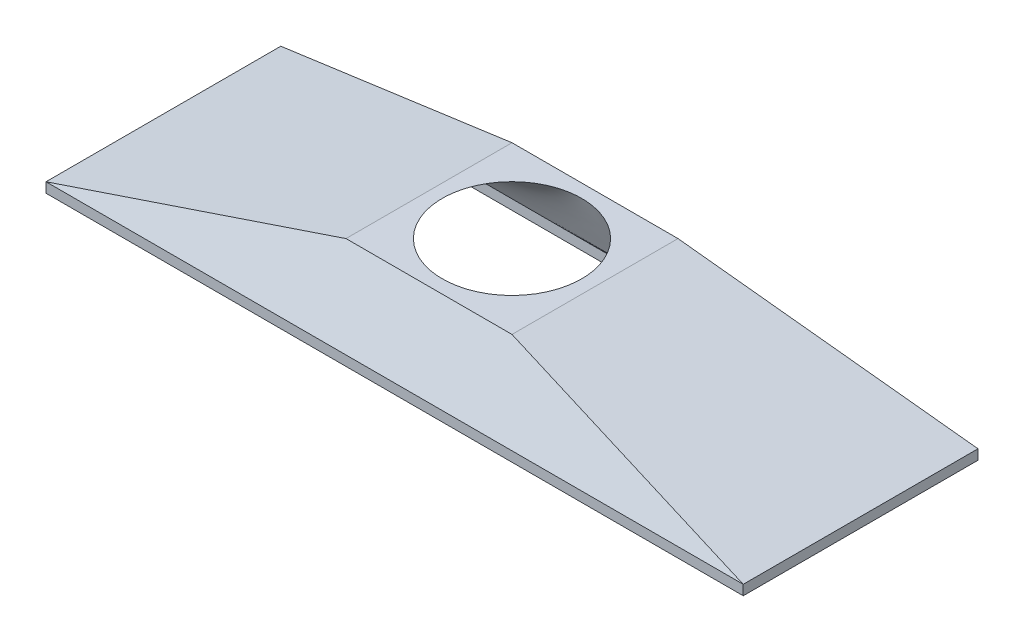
ISO-10303-21;
HEADER;
FILE_DESCRIPTION(('STEP AP214'),'2;1');
FILE_NAME('part.step','',(''),(''),'','','');
FILE_SCHEMA(('AUTOMOTIVE_DESIGN { 1 0 10303 214 1 1 1 1 }'));
ENDSEC;
DATA;
#1=APPLICATION_CONTEXT('core data for automotive mechanical design processes');
#2=APPLICATION_PROTOCOL_DEFINITION('international standard','automotive_design',2000,#1);
#3=PRODUCT_CONTEXT('',#1,'mechanical');
#4=PRODUCT('Part','Part','',(#3));
#5=PRODUCT_RELATED_PRODUCT_CATEGORY('part','',(#4));
#6=PRODUCT_DEFINITION_FORMATION('','',#4);
#7=PRODUCT_DEFINITION_CONTEXT('part definition',#1,'design');
#8=PRODUCT_DEFINITION('design','',#6,#7);
#9=PRODUCT_DEFINITION_SHAPE('','',#8);
#10=(LENGTH_UNIT() NAMED_UNIT(*) SI_UNIT(.MILLI.,.METRE.));
#11=(NAMED_UNIT(*) PLANE_ANGLE_UNIT() SI_UNIT($,.RADIAN.));
#12=(NAMED_UNIT(*) SI_UNIT($,.STERADIAN.) SOLID_ANGLE_UNIT());
#13=UNCERTAINTY_MEASURE_WITH_UNIT(LENGTH_MEASURE(1.E-05),#10,'distance_accuracy_value','');
#14=(GEOMETRIC_REPRESENTATION_CONTEXT(3) GLOBAL_UNCERTAINTY_ASSIGNED_CONTEXT((#13)) GLOBAL_UNIT_ASSIGNED_CONTEXT((#10,
#11,#12)) REPRESENTATION_CONTEXT('',''));
#15=CARTESIAN_POINT('',(0.,0.,0.));
#16=DIRECTION('',(0.,0.,1.));
#17=DIRECTION('',(1.,0.,0.));
#18=AXIS2_PLACEMENT_3D('',#15,#16,#17);
#19=CARTESIAN_POINT('',(0.,20.,0.));
#20=DIRECTION('',(0.,-1.,0.));
#21=DIRECTION('',(0.,0.,-1.));
#22=AXIS2_PLACEMENT_3D('',#19,#20,#21);
#23=PLANE('',#22);
#24=CARTESIAN_POINT('',(0.,20.,0.));
#25=DIRECTION('',(0.,1.,0.));
#26=DIRECTION('',(0.,0.,1.));
#27=AXIS2_PLACEMENT_3D('',#24,#25,#26);
#28=CIRCLE('',#27,21.);
#29=CARTESIAN_POINT('',(-20.0946117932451,20.,-6.09971940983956));
#30=VERTEX_POINT('',#29);
#31=CARTESIAN_POINT('',(-20.0946117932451,20.,6.09971940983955));
#32=VERTEX_POINT('',#31);
#33=EDGE_CURVE('E214',#30,#32,#28,.T.);
#34=ORIENTED_EDGE('',*,*,#33,.F.);
#35=CARTESIAN_POINT('',(20.0946117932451,20.,-6.09971940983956));
#36=VERTEX_POINT('',#35);
#37=EDGE_CURVE('E213',#36,#30,#28,.T.);
#38=ORIENTED_EDGE('',*,*,#37,.F.);
#39=CARTESIAN_POINT('',(20.0946117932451,20.,6.09971940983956));
#40=VERTEX_POINT('',#39);
#41=EDGE_CURVE('E211',#40,#36,#28,.T.);
#42=ORIENTED_EDGE('',*,*,#41,.F.);
#43=EDGE_CURVE('E206',#32,#40,#28,.T.);
#44=ORIENTED_EDGE('',*,*,#43,.F.);
#45=EDGE_LOOP('',(#34,#38,#42,#44));
#46=FACE_BOUND('',#45,.T.);
#47=DIRECTION('',(0.,0.,-1.));
#48=VECTOR('',#47,1.);
#49=CARTESIAN_POINT('',(25.,20.,25.));
#50=LINE('',#49,#48);
#51=CARTESIAN_POINT('',(25.,20.,25.));
#52=VERTEX_POINT('',#51);
#53=CARTESIAN_POINT('',(25.,20.,-25.));
#54=VERTEX_POINT('',#53);
#55=EDGE_CURVE('E303',#52,#54,#50,.T.);
#56=ORIENTED_EDGE('',*,*,#55,.T.);
#57=DIRECTION('',(-1.,0.,0.));
#58=VECTOR('',#57,1.);
#59=CARTESIAN_POINT('',(-25.,20.,-25.));
#60=LINE('',#59,#58);
#61=CARTESIAN_POINT('',(-25.,20.,-25.));
#62=VERTEX_POINT('',#61);
#63=EDGE_CURVE('E564',#54,#62,#60,.T.);
#64=ORIENTED_EDGE('',*,*,#63,.T.);
#65=DIRECTION('',(0.,0.,1.));
#66=VECTOR('',#65,1.);
#67=CARTESIAN_POINT('',(-25.,20.,25.));
#68=LINE('',#67,#66);
#69=CARTESIAN_POINT('',(-25.,20.,25.));
#70=VERTEX_POINT('',#69);
#71=EDGE_CURVE('E560',#62,#70,#68,.T.);
#72=ORIENTED_EDGE('',*,*,#71,.T.);
#73=DIRECTION('',(1.,0.,0.));
#74=VECTOR('',#73,1.);
#75=CARTESIAN_POINT('',(-25.,20.,25.));
#76=LINE('',#75,#74);
#77=EDGE_CURVE('E557',#70,#52,#76,.T.);
#78=ORIENTED_EDGE('',*,*,#77,.T.);
#79=EDGE_LOOP('',(#56,#64,#72,#78));
#80=FACE_BOUND('',#79,.T.);
#81=ADVANCED_FACE('F71',(#46,#80),#23,.F.);
#82=CARTESIAN_POINT('',(0.,14.4354195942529,-27.8810615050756));
#83=DIRECTION('',(0.,0.459779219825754,-0.888033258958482));
#84=DIRECTION('',(0.,0.888033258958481,0.459779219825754));
#85=AXIS2_PLACEMENT_3D('',#82,#83,#84);
#86=PLANE('',#85);
#87=DIRECTION('',(0.962582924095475,-0.240645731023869,-0.124594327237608));
#88=VECTOR('',#87,1.);
#89=CARTESIAN_POINT('',(25.,20.,-25.));
#90=LINE('',#89,#88);
#91=CARTESIAN_POINT('',(105.,0.,-35.355));
#92=VERTEX_POINT('',#91);
#93=EDGE_CURVE('E559',#54,#92,#90,.T.);
#94=ORIENTED_EDGE('',*,*,#93,.T.);
#95=DIRECTION('',(-1.,0.,0.));
#96=VECTOR('',#95,1.);
#97=CARTESIAN_POINT('',(-105.,0.,-35.355));
#98=LINE('',#97,#96);
#99=CARTESIAN_POINT('',(-105.,0.,-35.355));
#100=VERTEX_POINT('',#99);
#101=EDGE_CURVE('E76',#92,#100,#98,.T.);
#102=ORIENTED_EDGE('',*,*,#101,.T.);
#103=DIRECTION('',(-0.962582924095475,-0.240645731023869,-0.124594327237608));
#104=VECTOR('',#103,1.);
#105=CARTESIAN_POINT('',(-25.,20.,-25.));
#106=LINE('',#105,#104);
#107=EDGE_CURVE('E526',#62,#100,#106,.T.);
#108=ORIENTED_EDGE('',*,*,#107,.F.);
#109=ORIENTED_EDGE('',*,*,#63,.F.);
#110=EDGE_LOOP('',(#94,#102,#108,#109));
#111=FACE_BOUND('',#110,.T.);
#112=ADVANCED_FACE('F343',(#111),#86,.T.);
#113=CARTESIAN_POINT('',(-6.17647058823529,24.7058823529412,0.));
#114=DIRECTION('',(-0.242535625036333,0.970142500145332,0.));
#115=DIRECTION('',(-0.970142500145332,-0.242535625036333,0.));
#116=AXIS2_PLACEMENT_3D('',#113,#114,#115);
#117=PLANE('',#116);
#118=ORIENTED_EDGE('',*,*,#107,.T.);
#119=DIRECTION('',(0.,0.,1.));
#120=VECTOR('',#119,1.);
#121=CARTESIAN_POINT('',(-105.,0.,35.355));
#122=LINE('',#121,#120);
#123=CARTESIAN_POINT('',(-105.,0.,35.355));
#124=VERTEX_POINT('',#123);
#125=EDGE_CURVE('E82',#100,#124,#122,.T.);
#126=ORIENTED_EDGE('',*,*,#125,.T.);
#127=DIRECTION('',(-0.962582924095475,-0.240645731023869,0.124594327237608));
#128=VECTOR('',#127,1.);
#129=CARTESIAN_POINT('',(-25.,20.,25.));
#130=LINE('',#129,#128);
#131=EDGE_CURVE('E516',#70,#124,#130,.T.);
#132=ORIENTED_EDGE('',*,*,#131,.F.);
#133=ORIENTED_EDGE('',*,*,#71,.F.);
#134=EDGE_LOOP('',(#118,#126,#132,#133));
#135=FACE_BOUND('',#134,.T.);
#136=ADVANCED_FACE('F349',(#135),#117,.T.);
#137=CARTESIAN_POINT('',(6.17647058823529,24.7058823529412,0.));
#138=DIRECTION('',(0.242535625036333,0.970142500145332,0.));
#139=DIRECTION('',(-0.970142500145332,0.242535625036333,0.));
#140=AXIS2_PLACEMENT_3D('',#137,#138,#139);
#141=PLANE('',#140);
#142=DIRECTION('',(0.962582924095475,-0.240645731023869,0.124594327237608));
#143=VECTOR('',#142,1.);
#144=CARTESIAN_POINT('',(25.,20.,25.));
#145=LINE('',#144,#143);
#146=CARTESIAN_POINT('',(105.,0.,35.355));
#147=VERTEX_POINT('',#146);
#148=EDGE_CURVE('E520',#52,#147,#145,.T.);
#149=ORIENTED_EDGE('',*,*,#148,.T.);
#150=DIRECTION('',(0.,0.,-1.));
#151=VECTOR('',#150,1.);
#152=CARTESIAN_POINT('',(105.,0.,35.355));
#153=LINE('',#152,#151);
#154=EDGE_CURVE('E511',#147,#92,#153,.T.);
#155=ORIENTED_EDGE('',*,*,#154,.T.);
#156=ORIENTED_EDGE('',*,*,#93,.F.);
#157=ORIENTED_EDGE('',*,*,#55,.F.);
#158=EDGE_LOOP('',(#149,#155,#156,#157));
#159=FACE_BOUND('',#158,.T.);
#160=ADVANCED_FACE('F521',(#159),#141,.T.);
#161=CARTESIAN_POINT('',(0.,14.4354195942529,27.8810615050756));
#162=DIRECTION('',(0.,0.459779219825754,0.888033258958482));
#163=DIRECTION('',(0.,-0.888033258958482,0.459779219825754));
#164=AXIS2_PLACEMENT_3D('',#161,#162,#163);
#165=PLANE('',#164);
#166=ORIENTED_EDGE('',*,*,#131,.T.);
#167=DIRECTION('',(1.,0.,0.));
#168=VECTOR('',#167,1.);
#169=CARTESIAN_POINT('',(-105.,0.,35.355));
#170=LINE('',#169,#168);
#171=EDGE_CURVE('E12',#124,#147,#170,.T.);
#172=ORIENTED_EDGE('',*,*,#171,.T.);
#173=ORIENTED_EDGE('',*,*,#148,.F.);
#174=ORIENTED_EDGE('',*,*,#77,.F.);
#175=EDGE_LOOP('',(#166,#172,#173,#174));
#176=FACE_BOUND('',#175,.T.);
#177=ADVANCED_FACE('F73',(#176),#165,.T.);
#178=CARTESIAN_POINT('',(-20.0946117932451,20.,-6.09971940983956));
#179=CARTESIAN_POINT('',(-100.,0.,-30.355));
#180=CARTESIAN_POINT('',(-19.8514143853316,20.,-6.90089683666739));
#181=CARTESIAN_POINT('',(-95.8333333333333,0.,-30.355));
#182=CARTESIAN_POINT('',(-19.5494886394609,20.,-7.72343461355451));
#183=CARTESIAN_POINT('',(-91.6666666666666,0.,-30.355));
#184=CARTESIAN_POINT('',(-18.8052345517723,20.,-9.39133120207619));
#185=CARTESIAN_POINT('',(-83.3333333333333,0.,-30.355));
#186=CARTESIAN_POINT('',(-18.3627793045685,20.,-10.2367293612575));
#187=CARTESIAN_POINT('',(-79.1666666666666,0.,-30.355));
#188=CARTESIAN_POINT('',(-17.3170494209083,20.,-11.9206581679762));
#189=CARTESIAN_POINT('',(-70.8333333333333,0.,-30.355));
#190=CARTESIAN_POINT('',(-16.713606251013,20.,-12.7591706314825));
#191=CARTESIAN_POINT('',(-66.6666666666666,0.,-30.355));
#192=CARTESIAN_POINT('',(-15.3326447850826,20.,-14.3892693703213));
#193=CARTESIAN_POINT('',(-58.3333333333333,0.,-30.355));
#194=CARTESIAN_POINT('',(-14.5549457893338,20.,-15.1807452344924));
#195=CARTESIAN_POINT('',(-54.1666666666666,0.,-30.355));
#196=CARTESIAN_POINT('',(-12.8247608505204,20.,-16.6681427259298));
#197=CARTESIAN_POINT('',(-45.8333333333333,0.,-30.355));
#198=CARTESIAN_POINT('',(-11.8721404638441,20.,-17.3638449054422));
#199=CARTESIAN_POINT('',(-41.6666666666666,0.,-30.355));
#200=CARTESIAN_POINT('',(-9.80892561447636,20.,-18.6074126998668));
#201=CARTESIAN_POINT('',(-33.3333333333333,0.,-30.355));
#202=CARTESIAN_POINT('',(-8.69831655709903,20.,-19.1549764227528));
#203=CARTESIAN_POINT('',(-29.1666666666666,0.,-30.355));
#204=CARTESIAN_POINT('',(-6.35598204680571,20.,-20.0543093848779));
#205=CARTESIAN_POINT('',(-20.8333333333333,0.,-30.355));
#206=CARTESIAN_POINT('',(-5.12441306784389,20.,-20.4057757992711));
#207=CARTESIAN_POINT('',(-16.6666666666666,0.,-30.355));
#208=CARTESIAN_POINT('',(-2.59508363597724,20.,-20.8787173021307));
#209=CARTESIAN_POINT('',(-8.3333333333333,0.,-30.355));
#210=CARTESIAN_POINT('',(-1.29763596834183,20.,-21.));
#211=CARTESIAN_POINT('',(-4.16666666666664,0.,-30.355));
#212=CARTESIAN_POINT('',(1.29763596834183,20.,-21.));
#213=CARTESIAN_POINT('',(4.16666666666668,0.,-30.355));
#214=CARTESIAN_POINT('',(2.59508363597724,20.,-20.8787173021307));
#215=CARTESIAN_POINT('',(8.33333333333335,0.,-30.355));
#216=CARTESIAN_POINT('',(5.12441306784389,20.,-20.4057757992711));
#217=CARTESIAN_POINT('',(16.6666666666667,0.,-30.355));
#218=CARTESIAN_POINT('',(6.35598204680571,20.,-20.0543093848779));
#219=CARTESIAN_POINT('',(20.8333333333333,0.,-30.355));
#220=CARTESIAN_POINT('',(8.69831655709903,20.,-19.1549764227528));
#221=CARTESIAN_POINT('',(29.1666666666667,0.,-30.355));
#222=CARTESIAN_POINT('',(9.80892561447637,20.,-18.6074126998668));
#223=CARTESIAN_POINT('',(33.3333333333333,0.,-30.355));
#224=CARTESIAN_POINT('',(11.8721404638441,20.,-17.3638449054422));
#225=CARTESIAN_POINT('',(41.6666666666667,0.,-30.355));
#226=CARTESIAN_POINT('',(12.8247608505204,20.,-16.6681427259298));
#227=CARTESIAN_POINT('',(45.8333333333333,0.,-30.355));
#228=CARTESIAN_POINT('',(14.5549457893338,20.,-15.1807452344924));
#229=CARTESIAN_POINT('',(54.1666666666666,0.,-30.355));
#230=CARTESIAN_POINT('',(15.3326447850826,20.,-14.3892693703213));
#231=CARTESIAN_POINT('',(58.3333333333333,0.,-30.355));
#232=CARTESIAN_POINT('',(16.713606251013,20.,-12.7591706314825));
#233=CARTESIAN_POINT('',(66.6666666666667,0.,-30.355));
#234=CARTESIAN_POINT('',(17.3170494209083,20.,-11.9206581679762));
#235=CARTESIAN_POINT('',(70.8333333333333,0.,-30.355));
#236=CARTESIAN_POINT('',(18.3627793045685,20.,-10.2367293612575));
#237=CARTESIAN_POINT('',(79.1666666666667,0.,-30.355));
#238=CARTESIAN_POINT('',(18.8052345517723,20.,-9.39133120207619));
#239=CARTESIAN_POINT('',(83.3333333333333,0.,-30.355));
#240=CARTESIAN_POINT('',(19.5494886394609,20.,-7.72343461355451));
#241=CARTESIAN_POINT('',(91.6666666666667,0.,-30.355));
#242=CARTESIAN_POINT('',(19.8514143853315,20.,-6.90089683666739));
#243=CARTESIAN_POINT('',(95.8333333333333,0.,-30.355));
#244=CARTESIAN_POINT('',(20.0946117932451,20.,-6.09971940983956));
#245=CARTESIAN_POINT('',(100.,0.,-30.355));
#246=B_SPLINE_SURFACE_WITH_KNOTS('',3,1,((#178,#179),(#180,#181),(#182,#183),(#184,#185),(#186,
#187),(#188,#189),(#190,#191),(#192,#193),(#194,#195),(#196,#197),(#198,#199),(#200,#201),(#202,
#203),(#204,#205),(#206,#207),(#208,#209),(#210,#211),(#212,#213),(#214,#215),(#216,#217),(#218,
#219),(#220,#221),(#222,#223),(#224,#225),(#226,#227),(#228,#229),(#230,#231),(#232,#233),(#234,
#235),(#236,#237),(#238,#239),(#240,#241),(#242,#243),(#244,#245)),.UNSPECIFIED.,.F.,.F.,.F.,(4,
2,2,2,2,2,2,2,2,2,2,2,2,2,2,2,4),(2,2),(0.,0.0625000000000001,0.125,0.1875,0.25,0.3125,0.375,
0.4375,0.5,0.5625,0.625,0.6875,0.75,0.8125,0.875,0.9375,1.),(0.,1.),.UNSPECIFIED.);
#247=DIRECTION('',(0.930568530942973,0.232917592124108,0.282474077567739));
#248=VECTOR('',#247,1.);
#249=CARTESIAN_POINT('',(-60.0473058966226,10.,-18.2273597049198));
#250=LINE('',#249,#248);
#251=CARTESIAN_POINT('',(-100.,0.,-30.355));
#252=VERTEX_POINT('',#251);
#253=EDGE_CURVE('E422',#252,#30,#250,.T.);
#254=DIRECTION('',(1.,0.,0.));
#255=VECTOR('',#254,1.);
#256=CARTESIAN_POINT('',(100.,0.,-30.355));
#257=LINE('',#256,#255);
#258=CARTESIAN_POINT('',(100.,0.,-30.355));
#259=VERTEX_POINT('',#258);
#260=EDGE_CURVE('E318',#252,#259,#257,.T.);
#261=DIRECTION('',(0.930568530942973,-0.232917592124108,-0.282474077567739));
#262=VECTOR('',#261,1.);
#263=CARTESIAN_POINT('',(60.0473058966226,10.,-18.2273597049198));
#264=LINE('',#263,#262);
#265=EDGE_CURVE('E425',#36,#259,#264,.T.);
#266=ORIENTED_EDGE('',*,*,#37,.T.);
#267=ORIENTED_EDGE('',*,*,#253,.F.);
#268=ORIENTED_EDGE('',*,*,#260,.T.);
#269=ORIENTED_EDGE('',*,*,#265,.F.);
#270=EDGE_LOOP('',(#266,#267,#268,#269));
#271=FACE_BOUND('',#270,.T.);
#272=ADVANCED_FACE('F421',(#271),#246,.F.);
#273=CARTESIAN_POINT('',(20.0946117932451,20.,-6.09971940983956));
#274=CARTESIAN_POINT('',(100.,0.,-30.355));
#275=CARTESIAN_POINT('',(20.3899020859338,20.,-5.12692977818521));
#276=CARTESIAN_POINT('',(100.,0.,-25.2958333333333));
#277=CARTESIAN_POINT('',(20.6173956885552,20.,-4.12198476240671));
#278=CARTESIAN_POINT('',(100.,0.,-20.2366666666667));
#279=CARTESIAN_POINT('',(20.9224709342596,20.,-2.07797337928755));
#280=CARTESIAN_POINT('',(100.,0.,-10.1183333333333));
#281=CARTESIAN_POINT('',(21.,20.,-1.03901786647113));
#282=CARTESIAN_POINT('',(100.,0.,-5.05916666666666));
#283=CARTESIAN_POINT('',(21.,20.,1.03901786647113));
#284=CARTESIAN_POINT('',(100.,0.,5.05916666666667));
#285=CARTESIAN_POINT('',(20.9224709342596,20.,2.07797337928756));
#286=CARTESIAN_POINT('',(100.,0.,10.1183333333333));
#287=CARTESIAN_POINT('',(20.6173956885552,20.,4.12198476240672));
#288=CARTESIAN_POINT('',(100.,0.,20.2366666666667));
#289=CARTESIAN_POINT('',(20.3899020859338,20.,5.12692977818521));
#290=CARTESIAN_POINT('',(100.,0.,25.2958333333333));
#291=CARTESIAN_POINT('',(20.0946117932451,20.,6.09971940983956));
#292=CARTESIAN_POINT('',(100.,0.,30.355));
#293=B_SPLINE_SURFACE_WITH_KNOTS('',3,1,((#273,#274),(#275,#276),(#277,#278),(#279,#280),(#281,
#282),(#283,#284),(#285,#286),(#287,#288),(#289,#290),(#291,#292)),.UNSPECIFIED.,.F.,.F.,.F.,(4,
2,2,2,4),(2,2),(0.,0.25,0.5,0.75,1.),(0.,1.),.UNSPECIFIED.);
#294=DIRECTION('',(0.,0.,1.));
#295=VECTOR('',#294,1.);
#296=CARTESIAN_POINT('',(100.,0.,30.355));
#297=LINE('',#296,#295);
#298=CARTESIAN_POINT('',(100.,0.,30.355));
#299=VERTEX_POINT('',#298);
#300=EDGE_CURVE('E272',#259,#299,#297,.T.);
#301=DIRECTION('',(0.930568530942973,-0.232917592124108,0.282474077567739));
#302=VECTOR('',#301,1.);
#303=CARTESIAN_POINT('',(60.0473058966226,10.,18.2273597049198));
#304=LINE('',#303,#302);
#305=EDGE_CURVE('E434',#40,#299,#304,.T.);
#306=ORIENTED_EDGE('',*,*,#41,.T.);
#307=ORIENTED_EDGE('',*,*,#265,.T.);
#308=ORIENTED_EDGE('',*,*,#300,.T.);
#309=ORIENTED_EDGE('',*,*,#305,.F.);
#310=EDGE_LOOP('',(#306,#307,#308,#309));
#311=FACE_BOUND('',#310,.T.);
#312=ADVANCED_FACE('F467',(#311),#293,.F.);
#313=CARTESIAN_POINT('',(-20.0946117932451,20.,6.09971940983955));
#314=CARTESIAN_POINT('',(-100.,0.,30.355));
#315=CARTESIAN_POINT('',(-20.3899020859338,20.,5.1269297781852));
#316=CARTESIAN_POINT('',(-100.,0.,25.2958333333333));
#317=CARTESIAN_POINT('',(-20.6173956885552,20.,4.12198476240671));
#318=CARTESIAN_POINT('',(-100.,0.,20.2366666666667));
#319=CARTESIAN_POINT('',(-20.9224709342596,20.,2.07797337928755));
#320=CARTESIAN_POINT('',(-100.,0.,10.1183333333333));
#321=CARTESIAN_POINT('',(-21.,20.,1.03901786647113));
#322=CARTESIAN_POINT('',(-100.,0.,5.05916666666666));
#323=CARTESIAN_POINT('',(-21.,20.,-1.03901786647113));
#324=CARTESIAN_POINT('',(-100.,0.,-5.05916666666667));
#325=CARTESIAN_POINT('',(-20.9224709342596,20.,-2.07797337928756));
#326=CARTESIAN_POINT('',(-100.,0.,-10.1183333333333));
#327=CARTESIAN_POINT('',(-20.6173956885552,20.,-4.12198476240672));
#328=CARTESIAN_POINT('',(-100.,0.,-20.2366666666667));
#329=CARTESIAN_POINT('',(-20.3899020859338,20.,-5.12692977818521));
#330=CARTESIAN_POINT('',(-100.,0.,-25.2958333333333));
#331=CARTESIAN_POINT('',(-20.0946117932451,20.,-6.09971940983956));
#332=CARTESIAN_POINT('',(-100.,0.,-30.355));
#333=B_SPLINE_SURFACE_WITH_KNOTS('',3,1,((#313,#314),(#315,#316),(#317,#318),(#319,#320),(#321,
#322),(#323,#324),(#325,#326),(#327,#328),(#329,#330),(#331,#332)),.UNSPECIFIED.,.F.,.F.,.F.,(4,
2,2,2,4),(2,2),(0.,0.25,0.5,0.75,1.),(0.,1.),.UNSPECIFIED.);
#334=DIRECTION('',(-0.930568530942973,-0.232917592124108,0.282474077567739));
#335=VECTOR('',#334,1.);
#336=CARTESIAN_POINT('',(-60.0473058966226,10.,18.2273597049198));
#337=LINE('',#336,#335);
#338=CARTESIAN_POINT('',(-100.,0.,30.355));
#339=VERTEX_POINT('',#338);
#340=EDGE_CURVE('E97',#32,#339,#337,.T.);
#341=DIRECTION('',(0.,0.,-1.));
#342=VECTOR('',#341,1.);
#343=CARTESIAN_POINT('',(-100.,0.,30.355));
#344=LINE('',#343,#342);
#345=EDGE_CURVE('E431',#339,#252,#344,.T.);
#346=ORIENTED_EDGE('',*,*,#33,.T.);
#347=ORIENTED_EDGE('',*,*,#340,.T.);
#348=ORIENTED_EDGE('',*,*,#345,.T.);
#349=ORIENTED_EDGE('',*,*,#253,.T.);
#350=EDGE_LOOP('',(#346,#347,#348,#349));
#351=FACE_BOUND('',#350,.T.);
#352=ADVANCED_FACE('F429',(#351),#333,.F.);
#353=CARTESIAN_POINT('',(20.0946117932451,20.,6.09971940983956));
#354=CARTESIAN_POINT('',(100.,0.,30.355));
#355=CARTESIAN_POINT('',(19.8514143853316,20.,6.90089683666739));
#356=CARTESIAN_POINT('',(95.8333333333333,0.,30.355));
#357=CARTESIAN_POINT('',(19.5494886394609,20.,7.72343461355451));
#358=CARTESIAN_POINT('',(91.6666666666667,0.,30.355));
#359=CARTESIAN_POINT('',(18.8052345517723,20.,9.39133120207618));
#360=CARTESIAN_POINT('',(83.3333333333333,0.,30.355));
#361=CARTESIAN_POINT('',(18.3627793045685,20.,10.2367293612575));
#362=CARTESIAN_POINT('',(79.1666666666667,0.,30.355));
#363=CARTESIAN_POINT('',(17.3170494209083,20.,11.9206581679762));
#364=CARTESIAN_POINT('',(70.8333333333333,0.,30.355));
#365=CARTESIAN_POINT('',(16.713606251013,20.,12.7591706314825));
#366=CARTESIAN_POINT('',(66.6666666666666,0.,30.355));
#367=CARTESIAN_POINT('',(15.3326447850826,20.,14.3892693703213));
#368=CARTESIAN_POINT('',(58.3333333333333,0.,30.355));
#369=CARTESIAN_POINT('',(14.5549457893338,20.,15.1807452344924));
#370=CARTESIAN_POINT('',(54.1666666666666,0.,30.355));
#371=CARTESIAN_POINT('',(12.8247608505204,20.,16.6681427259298));
#372=CARTESIAN_POINT('',(45.8333333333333,0.,30.355));
#373=CARTESIAN_POINT('',(11.8721404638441,20.,17.3638449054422));
#374=CARTESIAN_POINT('',(41.6666666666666,0.,30.355));
#375=CARTESIAN_POINT('',(9.80892561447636,20.,18.6074126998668));
#376=CARTESIAN_POINT('',(33.3333333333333,0.,30.355));
#377=CARTESIAN_POINT('',(8.69831655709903,20.,19.1549764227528));
#378=CARTESIAN_POINT('',(29.1666666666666,0.,30.355));
#379=CARTESIAN_POINT('',(6.35598204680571,20.,20.0543093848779));
#380=CARTESIAN_POINT('',(20.8333333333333,0.,30.355));
#381=CARTESIAN_POINT('',(5.12441306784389,20.,20.4057757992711));
#382=CARTESIAN_POINT('',(16.6666666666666,0.,30.355));
#383=CARTESIAN_POINT('',(2.59508363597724,20.,20.8787173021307));
#384=CARTESIAN_POINT('',(8.33333333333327,0.,30.355));
#385=CARTESIAN_POINT('',(1.29763596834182,20.,21.));
#386=CARTESIAN_POINT('',(4.16666666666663,0.,30.355));
#387=CARTESIAN_POINT('',(-1.29763596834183,20.,21.));
#388=CARTESIAN_POINT('',(-4.1666666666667,0.,30.355));
#389=CARTESIAN_POINT('',(-2.59508363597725,20.,20.8787173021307));
#390=CARTESIAN_POINT('',(-8.33333333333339,0.,30.355));
#391=CARTESIAN_POINT('',(-5.12441306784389,20.,20.4057757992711));
#392=CARTESIAN_POINT('',(-16.6666666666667,0.,30.355));
#393=CARTESIAN_POINT('',(-6.35598204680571,20.,20.0543093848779));
#394=CARTESIAN_POINT('',(-20.8333333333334,0.,30.355));
#395=CARTESIAN_POINT('',(-8.69831655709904,20.,19.1549764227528));
#396=CARTESIAN_POINT('',(-29.1666666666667,0.,30.355));
#397=CARTESIAN_POINT('',(-9.80892561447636,20.,18.6074126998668));
#398=CARTESIAN_POINT('',(-33.3333333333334,0.,30.355));
#399=CARTESIAN_POINT('',(-11.8721404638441,20.,17.3638449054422));
#400=CARTESIAN_POINT('',(-41.6666666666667,0.,30.355));
#401=CARTESIAN_POINT('',(-12.8247608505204,20.,16.6681427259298));
#402=CARTESIAN_POINT('',(-45.8333333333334,0.,30.355));
#403=CARTESIAN_POINT('',(-14.5549457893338,20.,15.1807452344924));
#404=CARTESIAN_POINT('',(-54.1666666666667,0.,30.355));
#405=CARTESIAN_POINT('',(-15.3326447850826,20.,14.3892693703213));
#406=CARTESIAN_POINT('',(-58.3333333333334,0.,30.355));
#407=CARTESIAN_POINT('',(-16.713606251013,20.,12.7591706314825));
#408=CARTESIAN_POINT('',(-66.6666666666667,0.,30.355));
#409=CARTESIAN_POINT('',(-17.3170494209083,20.,11.9206581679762));
#410=CARTESIAN_POINT('',(-70.8333333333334,0.,30.355));
#411=CARTESIAN_POINT('',(-18.3627793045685,20.,10.2367293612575));
#412=CARTESIAN_POINT('',(-79.1666666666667,0.,30.355));
#413=CARTESIAN_POINT('',(-18.8052345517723,20.,9.39133120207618));
#414=CARTESIAN_POINT('',(-83.3333333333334,0.,30.355));
#415=CARTESIAN_POINT('',(-19.5494886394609,20.,7.7234346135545));
#416=CARTESIAN_POINT('',(-91.6666666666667,0.,30.355));
#417=CARTESIAN_POINT('',(-19.8514143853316,20.,6.90089683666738));
#418=CARTESIAN_POINT('',(-95.8333333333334,0.,30.355));
#419=CARTESIAN_POINT('',(-20.0946117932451,20.,6.09971940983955));
#420=CARTESIAN_POINT('',(-100.,0.,30.355));
#421=B_SPLINE_SURFACE_WITH_KNOTS('',3,1,((#353,#354),(#355,#356),(#357,#358),(#359,#360),(#361,
#362),(#363,#364),(#365,#366),(#367,#368),(#369,#370),(#371,#372),(#373,#374),(#375,#376),(#377,
#378),(#379,#380),(#381,#382),(#383,#384),(#385,#386),(#387,#388),(#389,#390),(#391,#392),(#393,
#394),(#395,#396),(#397,#398),(#399,#400),(#401,#402),(#403,#404),(#405,#406),(#407,#408),(#409,
#410),(#411,#412),(#413,#414),(#415,#416),(#417,#418),(#419,#420)),.UNSPECIFIED.,.F.,.F.,.F.,(4,
2,2,2,2,2,2,2,2,2,2,2,2,2,2,2,4),(2,2),(0.,0.0625000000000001,0.125,0.1875,0.25,0.3125,0.375,
0.4375,0.5,0.5625,0.625,0.6875,0.75,0.8125,0.875,0.9375,1.),(0.,1.),.UNSPECIFIED.);
#422=DIRECTION('',(-1.,0.,0.));
#423=VECTOR('',#422,1.);
#424=CARTESIAN_POINT('',(100.,0.,30.355));
#425=LINE('',#424,#423);
#426=EDGE_CURVE('E176',#299,#339,#425,.T.);
#427=ORIENTED_EDGE('',*,*,#43,.T.);
#428=ORIENTED_EDGE('',*,*,#305,.T.);
#429=ORIENTED_EDGE('',*,*,#426,.T.);
#430=ORIENTED_EDGE('',*,*,#340,.F.);
#431=EDGE_LOOP('',(#427,#428,#429,#430));
#432=FACE_BOUND('',#431,.T.);
#433=ADVANCED_FACE('F356',(#432),#421,.F.);
#434=CARTESIAN_POINT('',(0.,-3.,0.));
#435=DIRECTION('',(0.,-1.,0.));
#436=DIRECTION('',(0.,0.,-1.));
#437=AXIS2_PLACEMENT_3D('',#434,#435,#436);
#438=PLANE('',#437);
#439=DIRECTION('',(0.,0.,1.));
#440=VECTOR('',#439,1.);
#441=CARTESIAN_POINT('',(105.,-3.,-35.355));
#442=LINE('',#441,#440);
#443=CARTESIAN_POINT('',(105.,-3.,-35.355));
#444=VERTEX_POINT('',#443);
#445=CARTESIAN_POINT('',(105.,-3.,35.355));
#446=VERTEX_POINT('',#445);
#447=EDGE_CURVE('E179',#444,#446,#442,.T.);
#448=ORIENTED_EDGE('',*,*,#447,.T.);
#449=DIRECTION('',(-1.,0.,0.));
#450=VECTOR('',#449,1.);
#451=CARTESIAN_POINT('',(105.,-3.,35.355));
#452=LINE('',#451,#450);
#453=CARTESIAN_POINT('',(-105.,-3.,35.355));
#454=VERTEX_POINT('',#453);
#455=EDGE_CURVE('E193',#446,#454,#452,.T.);
#456=ORIENTED_EDGE('',*,*,#455,.T.);
#457=DIRECTION('',(0.,0.,-1.));
#458=VECTOR('',#457,1.);
#459=CARTESIAN_POINT('',(-105.,-3.,-35.355));
#460=LINE('',#459,#458);
#461=CARTESIAN_POINT('',(-105.,-3.,-35.355));
#462=VERTEX_POINT('',#461);
#463=EDGE_CURVE('E195',#454,#462,#460,.T.);
#464=ORIENTED_EDGE('',*,*,#463,.T.);
#465=DIRECTION('',(1.,0.,0.));
#466=VECTOR('',#465,1.);
#467=CARTESIAN_POINT('',(105.,-3.,-35.355));
#468=LINE('',#467,#466);
#469=EDGE_CURVE('E197',#462,#444,#468,.T.);
#470=ORIENTED_EDGE('',*,*,#469,.T.);
#471=EDGE_LOOP('',(#448,#456,#464,#470));
#472=FACE_BOUND('',#471,.T.);
#473=DIRECTION('',(-1.,0.,0.));
#474=VECTOR('',#473,1.);
#475=CARTESIAN_POINT('',(100.,-3.,30.355));
#476=LINE('',#475,#474);
#477=CARTESIAN_POINT('',(100.,-3.,30.355));
#478=VERTEX_POINT('',#477);
#479=CARTESIAN_POINT('',(-100.,-3.,30.355));
#480=VERTEX_POINT('',#479);
#481=EDGE_CURVE('E171',#478,#480,#476,.T.);
#482=ORIENTED_EDGE('',*,*,#481,.F.);
#483=DIRECTION('',(0.,0.,1.));
#484=VECTOR('',#483,1.);
#485=CARTESIAN_POINT('',(100.,-3.,-30.355));
#486=LINE('',#485,#484);
#487=CARTESIAN_POINT('',(100.,-3.,-30.355));
#488=VERTEX_POINT('',#487);
#489=EDGE_CURVE('E164',#488,#478,#486,.T.);
#490=ORIENTED_EDGE('',*,*,#489,.F.);
#491=DIRECTION('',(1.,0.,0.));
#492=VECTOR('',#491,1.);
#493=CARTESIAN_POINT('',(100.,-3.,-30.355));
#494=LINE('',#493,#492);
#495=CARTESIAN_POINT('',(-100.,-3.,-30.355));
#496=VERTEX_POINT('',#495);
#497=EDGE_CURVE('E187',#496,#488,#494,.T.);
#498=ORIENTED_EDGE('',*,*,#497,.F.);
#499=DIRECTION('',(0.,0.,-1.));
#500=VECTOR('',#499,1.);
#501=CARTESIAN_POINT('',(-100.,-3.,-30.355));
#502=LINE('',#501,#500);
#503=EDGE_CURVE('E185',#480,#496,#502,.T.);
#504=ORIENTED_EDGE('',*,*,#503,.F.);
#505=EDGE_LOOP('',(#482,#490,#498,#504));
#506=FACE_BOUND('',#505,.T.);
#507=ADVANCED_FACE('F183',(#472,#506),#438,.T.);
#508=CARTESIAN_POINT('',(105.,-3.,-35.355));
#509=DIRECTION('',(-1.,0.,0.));
#510=DIRECTION('',(0.,0.,1.));
#511=AXIS2_PLACEMENT_3D('',#508,#509,#510);
#512=PLANE('',#511);
#513=ORIENTED_EDGE('',*,*,#154,.F.);
#514=DIRECTION('',(0.,1.,0.));
#515=VECTOR('',#514,1.);
#516=CARTESIAN_POINT('',(105.,-3.,35.355));
#517=LINE('',#516,#515);
#518=EDGE_CURVE('E266',#446,#147,#517,.T.);
#519=ORIENTED_EDGE('',*,*,#518,.F.);
#520=ORIENTED_EDGE('',*,*,#447,.F.);
#521=DIRECTION('',(0.,1.,0.));
#522=VECTOR('',#521,1.);
#523=CARTESIAN_POINT('',(105.,-3.,-35.355));
#524=LINE('',#523,#522);
#525=EDGE_CURVE('E199',#444,#92,#524,.T.);
#526=ORIENTED_EDGE('',*,*,#525,.T.);
#527=EDGE_LOOP('',(#513,#519,#520,#526));
#528=FACE_BOUND('',#527,.T.);
#529=ADVANCED_FACE('F250',(#528),#512,.F.);
#530=CARTESIAN_POINT('',(105.,-3.,35.355));
#531=DIRECTION('',(0.,0.,-1.));
#532=DIRECTION('',(-1.,0.,0.));
#533=AXIS2_PLACEMENT_3D('',#530,#531,#532);
#534=PLANE('',#533);
#535=ORIENTED_EDGE('',*,*,#171,.F.);
#536=DIRECTION('',(0.,1.,0.));
#537=VECTOR('',#536,1.);
#538=CARTESIAN_POINT('',(-105.,-3.,35.355));
#539=LINE('',#538,#537);
#540=EDGE_CURVE('E218',#454,#124,#539,.T.);
#541=ORIENTED_EDGE('',*,*,#540,.F.);
#542=ORIENTED_EDGE('',*,*,#455,.F.);
#543=ORIENTED_EDGE('',*,*,#518,.T.);
#544=EDGE_LOOP('',(#535,#541,#542,#543));
#545=FACE_BOUND('',#544,.T.);
#546=ADVANCED_FACE('F245',(#545),#534,.F.);
#547=CARTESIAN_POINT('',(-105.,-3.,-35.355));
#548=DIRECTION('',(1.,0.,0.));
#549=DIRECTION('',(0.,0.,-1.));
#550=AXIS2_PLACEMENT_3D('',#547,#548,#549);
#551=PLANE('',#550);
#552=ORIENTED_EDGE('',*,*,#125,.F.);
#553=DIRECTION('',(0.,1.,0.));
#554=VECTOR('',#553,1.);
#555=CARTESIAN_POINT('',(-105.,-3.,-35.355));
#556=LINE('',#555,#554);
#557=EDGE_CURVE('E216',#462,#100,#556,.T.);
#558=ORIENTED_EDGE('',*,*,#557,.F.);
#559=ORIENTED_EDGE('',*,*,#463,.F.);
#560=ORIENTED_EDGE('',*,*,#540,.T.);
#561=EDGE_LOOP('',(#552,#558,#559,#560));
#562=FACE_BOUND('',#561,.T.);
#563=ADVANCED_FACE('F241',(#562),#551,.F.);
#564=CARTESIAN_POINT('',(105.,-3.,-35.355));
#565=DIRECTION('',(0.,0.,1.));
#566=DIRECTION('',(1.,0.,0.));
#567=AXIS2_PLACEMENT_3D('',#564,#565,#566);
#568=PLANE('',#567);
#569=ORIENTED_EDGE('',*,*,#101,.F.);
#570=ORIENTED_EDGE('',*,*,#525,.F.);
#571=ORIENTED_EDGE('',*,*,#469,.F.);
#572=ORIENTED_EDGE('',*,*,#557,.T.);
#573=EDGE_LOOP('',(#569,#570,#571,#572));
#574=FACE_BOUND('',#573,.T.);
#575=ADVANCED_FACE('F231',(#574),#568,.F.);
#576=CARTESIAN_POINT('',(100.,-3.,-30.355));
#577=DIRECTION('',(-1.,0.,0.));
#578=DIRECTION('',(0.,0.,1.));
#579=AXIS2_PLACEMENT_3D('',#576,#577,#578);
#580=PLANE('',#579);
#581=ORIENTED_EDGE('',*,*,#300,.F.);
#582=DIRECTION('',(0.,1.,0.));
#583=VECTOR('',#582,1.);
#584=CARTESIAN_POINT('',(100.,-3.,-30.355));
#585=LINE('',#584,#583);
#586=EDGE_CURVE('E167',#488,#259,#585,.T.);
#587=ORIENTED_EDGE('',*,*,#586,.F.);
#588=ORIENTED_EDGE('',*,*,#489,.T.);
#589=DIRECTION('',(0.,1.,0.));
#590=VECTOR('',#589,1.);
#591=CARTESIAN_POINT('',(100.,-3.,30.355));
#592=LINE('',#591,#590);
#593=EDGE_CURVE('E89',#478,#299,#592,.T.);
#594=ORIENTED_EDGE('',*,*,#593,.T.);
#595=EDGE_LOOP('',(#581,#587,#588,#594));
#596=FACE_BOUND('',#595,.T.);
#597=ADVANCED_FACE('F165',(#596),#580,.T.);
#598=CARTESIAN_POINT('',(100.,-3.,30.355));
#599=DIRECTION('',(0.,0.,-1.));
#600=DIRECTION('',(-1.,0.,0.));
#601=AXIS2_PLACEMENT_3D('',#598,#599,#600);
#602=PLANE('',#601);
#603=ORIENTED_EDGE('',*,*,#426,.F.);
#604=ORIENTED_EDGE('',*,*,#593,.F.);
#605=ORIENTED_EDGE('',*,*,#481,.T.);
#606=DIRECTION('',(0.,1.,0.));
#607=VECTOR('',#606,1.);
#608=CARTESIAN_POINT('',(-100.,-3.,30.355));
#609=LINE('',#608,#607);
#610=EDGE_CURVE('E180',#480,#339,#609,.T.);
#611=ORIENTED_EDGE('',*,*,#610,.T.);
#612=EDGE_LOOP('',(#603,#604,#605,#611));
#613=FACE_BOUND('',#612,.T.);
#614=ADVANCED_FACE('F174',(#613),#602,.T.);
#615=CARTESIAN_POINT('',(-100.,-3.,-30.355));
#616=DIRECTION('',(1.,0.,0.));
#617=DIRECTION('',(0.,0.,-1.));
#618=AXIS2_PLACEMENT_3D('',#615,#616,#617);
#619=PLANE('',#618);
#620=ORIENTED_EDGE('',*,*,#345,.F.);
#621=ORIENTED_EDGE('',*,*,#610,.F.);
#622=ORIENTED_EDGE('',*,*,#503,.T.);
#623=DIRECTION('',(0.,1.,0.));
#624=VECTOR('',#623,1.);
#625=CARTESIAN_POINT('',(-100.,-3.,-30.355));
#626=LINE('',#625,#624);
#627=EDGE_CURVE('E328',#496,#252,#626,.T.);
#628=ORIENTED_EDGE('',*,*,#627,.T.);
#629=EDGE_LOOP('',(#620,#621,#622,#628));
#630=FACE_BOUND('',#629,.T.);
#631=ADVANCED_FACE('F288',(#630),#619,.T.);
#632=CARTESIAN_POINT('',(100.,-3.,-30.355));
#633=DIRECTION('',(0.,0.,1.));
#634=DIRECTION('',(1.,0.,0.));
#635=AXIS2_PLACEMENT_3D('',#632,#633,#634);
#636=PLANE('',#635);
#637=ORIENTED_EDGE('',*,*,#260,.F.);
#638=ORIENTED_EDGE('',*,*,#627,.F.);
#639=ORIENTED_EDGE('',*,*,#497,.T.);
#640=ORIENTED_EDGE('',*,*,#586,.T.);
#641=EDGE_LOOP('',(#637,#638,#639,#640));
#642=FACE_BOUND('',#641,.T.);
#643=ADVANCED_FACE('F330',(#642),#636,.T.);
#644=CLOSED_SHELL('',(#81,#112,#136,#160,#177,#272,#312,#352,#433,#507,#529,#546,#563,#575,#597,
#614,#631,#643));
#645=MANIFOLD_SOLID_BREP('B2',#644);
#646=ADVANCED_BREP_SHAPE_REPRESENTATION('',(#18,#645),#14);
#647=SHAPE_DEFINITION_REPRESENTATION(#9,#646);
ENDSEC;
END-ISO-10303-21;
